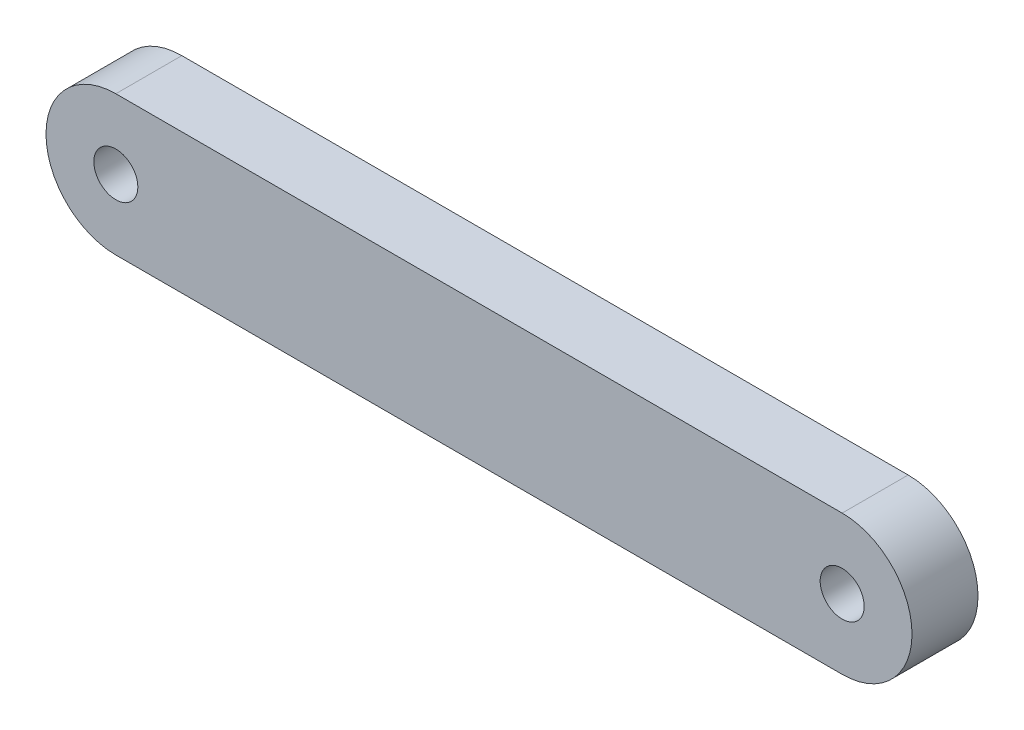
from build123d import *

# Parameters (mm, degrees)
SKETCH2_W           = 33.02
SKETCH2_H           = 6.35
EXTRUDE_THIN1_DEPTH = 3.000000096
SKETCH3_R           = 3.175
SKETCH3_R_2         = 1.000000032
BOSS_EXTRUDE1_DEPTH = 3
CUT_EXTRUDE1_DEPTH  = 37.457628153


with BuildPart() as part:
    # Sketch2 → Extrude-Thin1 (new body)
    with BuildSketch(Plane.XY):
        with Locations((16.51, 0)):
            Rectangle(SKETCH2_W, SKETCH2_H)
    extrude(amount=EXTRUDE_THIN1_DEPTH)

    # Sketch3 → Boss-Extrude1 (add, through all)
    # profile 1 of 2: a face of its own
    with BuildSketch(Plane.XY.offset(3.000000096)):
        Circle(SKETCH3_R)
        Circle(SKETCH3_R_2, mode=Mode.SUBTRACT)
    # profile 2 of 2: a face of its own
    with BuildSketch(Plane.XY.offset(3.000000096)):
        with Locations((33.02, 0)):
            Circle(SKETCH3_R)
        with Locations((33.02, 0)):
            Circle(SKETCH3_R_2, mode=Mode.SUBTRACT)
    extrude(amount=-BOSS_EXTRUDE1_DEPTH)

    # Sketch3_2 → Cut-Extrude1 (cut, through all)
    with BuildSketch(Plane.XY.offset(3.000000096)):
        with BuildLine():
            Line((0, -1.000000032), (0, 1.000000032))
            ThreePointArc((0, 1.000000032), (-1.000000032, 0), (0, -1.000000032))
        make_face()
        with BuildLine():
            ThreePointArc((1.000000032, 0), (0.707106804, 0.707106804), (0, 1.000000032))
            Line((0, 1.000000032), (0, -1.000000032))
            ThreePointArc((0, -1.000000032), (0.707106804, -0.707106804), (1.000000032, 0))
        make_face()
        with BuildLine():
            Line((33.02, -1.000000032), (33.02, 1.000000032))
            ThreePointArc((33.02, 1.000000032), (32.019999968, 0), (33.02, -1.000000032))
        make_face()
        with BuildLine():
            ThreePointArc((34.020000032, 0), (33.727106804, 0.707106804), (33.02, 1.000000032))
            Line((33.02, 1.000000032), (33.02, -1.000000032))
            ThreePointArc((33.02, -1.000000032), (33.727106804, -0.707106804), (34.020000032, 0))
        make_face()
    extrude(amount=-CUT_EXTRUDE1_DEPTH, mode=Mode.SUBTRACT)


solid = part.part
